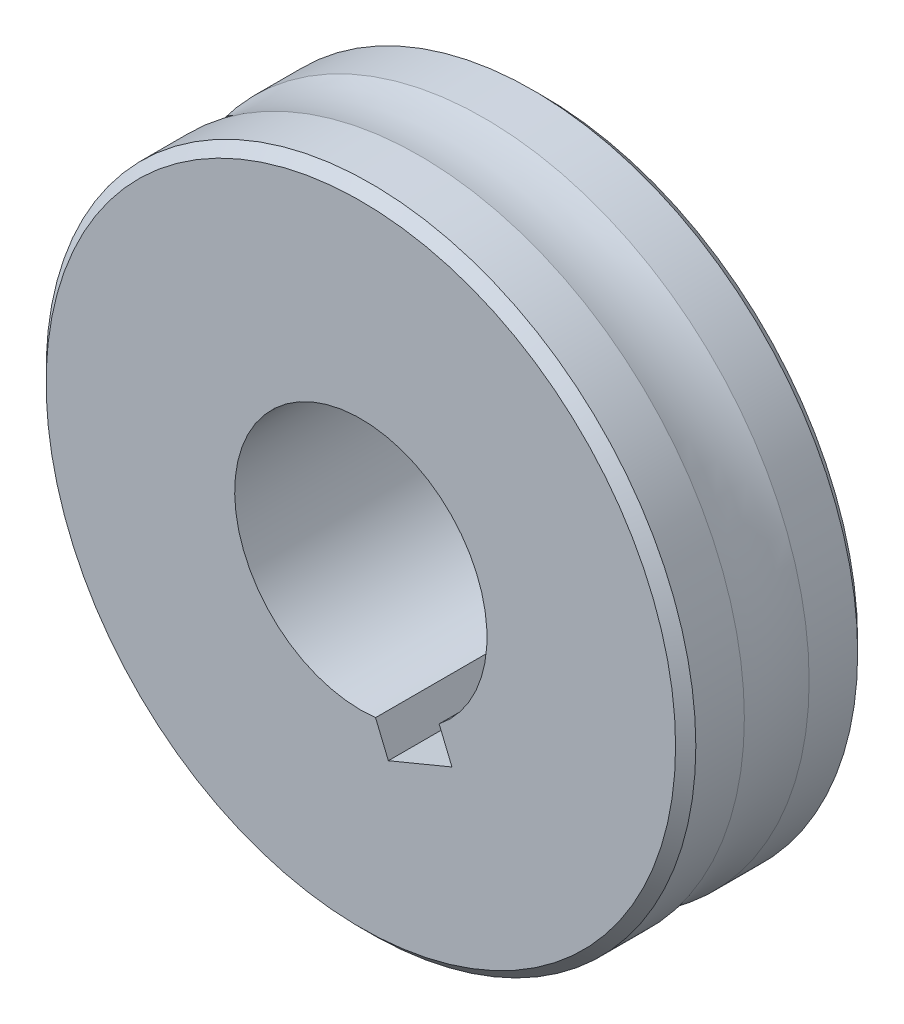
from build123d import *

# Parameters (mm, degrees)
CUT_EXTRUDE_1_DEPTH = 44.085894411


with BuildPart() as part:
    # WormGear-BaseSketch → 2.0 Module_ Coarse Pitch Involute 20 deg (revolve)
    with BuildSketch(Plane(origin=(0, 0, 0), x_dir=(0, 0, -1), z_dir=(1, 0, 0)), mode=Mode.PRIVATE) as f_2_0_module_coarse_pitch_involute_20_deg_sk:
        with BuildLine():
            Line((7.9375, 0), (-7.9375, 0))
            Line((-7.9375, 0), (-7.9375, 27.440297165))
            Line((-7.9375, 27.440297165), (-7.05485, 28.322947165))
            Line((-7.05485, 28.322947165), (-2.824850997, 28.322947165))
            ThreePointArc((-2.824850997, 28.322947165), (0, 28), (2.824850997, 28.322947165))
            Line((2.824850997, 28.322947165), (7.05485, 28.322947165))
            Line((7.05485, 28.322947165), (7.9375, 27.440297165))
            Line((7.9375, 27.440297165), (7.9375, 0))
        make_face()
    revolve(f_2_0_module_coarse_pitch_involute_20_deg_sk.sketch.rotate(Axis((0, 0, 15.875), (0, 0, -1)), 90), axis=Axis((0, 0, 15.875), (0, 0, -1)))

    # Sketch 1 → Cut-Extrude 1 (cut, through all)
    with BuildSketch(Plane.XY.offset(7.9375)):
        with BuildLine():
            Line((1.282625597, -10.924965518), (2.399977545, -13.619475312))
            Line((2.399977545, -13.619475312), (7.942345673, -11.321181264))
            Line((7.942345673, -11.321181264), (6.824993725, -8.62667147))
            ThreePointArc((6.824993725, -8.62667147), (-4.213539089, 10.161008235), (1.282625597, -10.924965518))
        make_face()
    extrude(amount=-CUT_EXTRUDE_1_DEPTH, mode=Mode.SUBTRACT)


solid = part.part
